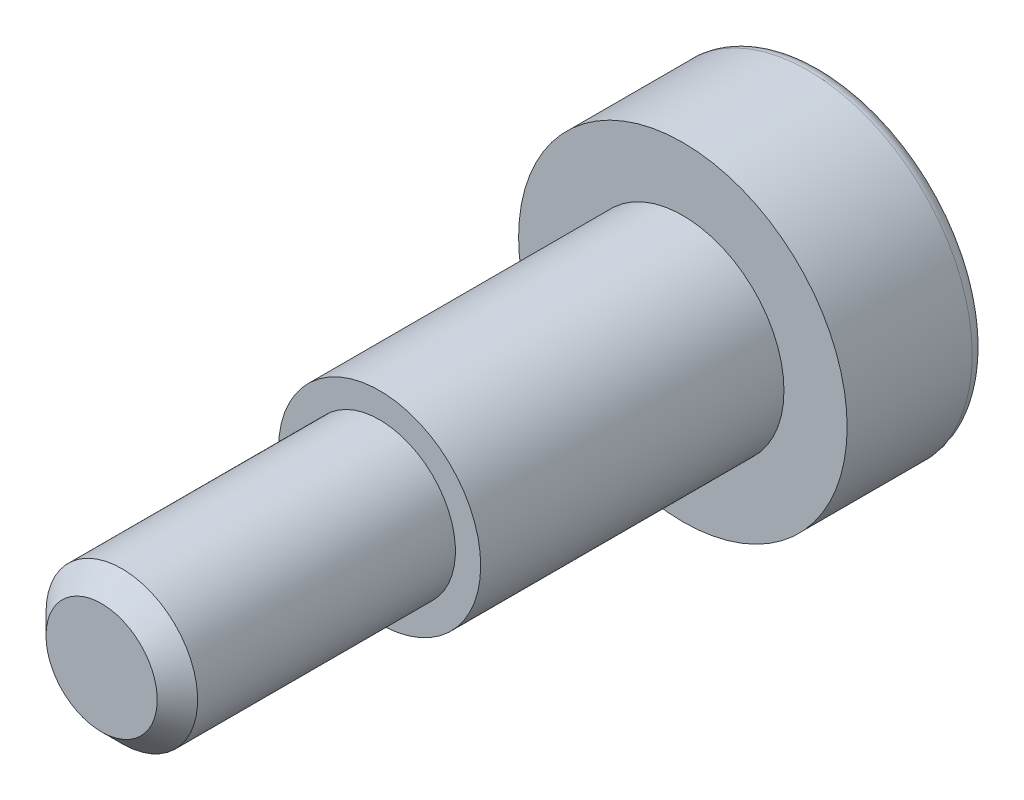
ISO-10303-21;
HEADER;
FILE_DESCRIPTION(('STEP AP214'),'2;1');
FILE_NAME('part.step','',(''),(''),'','','');
FILE_SCHEMA(('AUTOMOTIVE_DESIGN { 1 0 10303 214 1 1 1 1 }'));
ENDSEC;
DATA;
#1=APPLICATION_CONTEXT('core data for automotive mechanical design processes');
#2=APPLICATION_PROTOCOL_DEFINITION('international standard','automotive_design',2000,#1);
#3=PRODUCT_CONTEXT('',#1,'mechanical');
#4=PRODUCT('Part','Part','',(#3));
#5=PRODUCT_RELATED_PRODUCT_CATEGORY('part','',(#4));
#6=PRODUCT_DEFINITION_FORMATION('','',#4);
#7=PRODUCT_DEFINITION_CONTEXT('part definition',#1,'design');
#8=PRODUCT_DEFINITION('design','',#6,#7);
#9=PRODUCT_DEFINITION_SHAPE('','',#8);
#10=(LENGTH_UNIT() NAMED_UNIT(*) SI_UNIT(.MILLI.,.METRE.));
#11=(NAMED_UNIT(*) PLANE_ANGLE_UNIT() SI_UNIT($,.RADIAN.));
#12=(NAMED_UNIT(*) SI_UNIT($,.STERADIAN.) SOLID_ANGLE_UNIT());
#13=UNCERTAINTY_MEASURE_WITH_UNIT(LENGTH_MEASURE(1.E-05),#10,'distance_accuracy_value','');
#14=(GEOMETRIC_REPRESENTATION_CONTEXT(3) GLOBAL_UNCERTAINTY_ASSIGNED_CONTEXT((#13)) GLOBAL_UNIT_ASSIGNED_CONTEXT((#10,
#11,#12)) REPRESENTATION_CONTEXT('',''));
#15=CARTESIAN_POINT('',(0.,0.,0.));
#16=DIRECTION('',(0.,0.,1.));
#17=DIRECTION('',(1.,0.,0.));
#18=AXIS2_PLACEMENT_3D('',#15,#16,#17);
#19=CARTESIAN_POINT('',(0.,1.38777878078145E-13,12.));
#20=DIRECTION('',(0.,0.,0.999999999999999));
#21=DIRECTION('',(0.999999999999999,0.,0.));
#22=AXIS2_PLACEMENT_3D('',#19,#20,#21);
#23=PLANE('',#22);
#24=CARTESIAN_POINT('',(0.,1.38777878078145E-13,12.));
#25=DIRECTION('',(0.,0.,0.999999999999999));
#26=DIRECTION('',(0.999999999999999,0.,0.));
#27=AXIS2_PLACEMENT_3D('',#24,#25,#26);
#28=CIRCLE('',#27,4.);
#29=CARTESIAN_POINT('',(4.00000000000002,1.38666855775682E-13,12.));
#30=VERTEX_POINT('',#29);
#31=EDGE_CURVE('E107',#30,#30,#28,.T.);
#32=ORIENTED_EDGE('',*,*,#31,.T.);
#33=EDGE_LOOP('',(#32));
#34=FACE_BOUND('',#33,.T.);
#35=CARTESIAN_POINT('',(0.,1.38777878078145E-13,12.));
#36=DIRECTION('',(0.,0.,0.999999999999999));
#37=DIRECTION('',(0.999999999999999,0.,0.));
#38=AXIS2_PLACEMENT_3D('',#35,#36,#37);
#39=CIRCLE('',#38,3.);
#40=CARTESIAN_POINT('',(-2.99999999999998,1.38861144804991E-13,12.));
#41=VERTEX_POINT('',#40);
#42=EDGE_CURVE('E312',#41,#41,#39,.T.);
#43=ORIENTED_EDGE('',*,*,#42,.F.);
#44=EDGE_LOOP('',(#43));
#45=FACE_BOUND('',#44,.T.);
#46=ADVANCED_FACE('F32',(#34,#45),#23,.T.);
#47=CARTESIAN_POINT('',(0.,1.38777878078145E-13,-5.50000000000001));
#48=DIRECTION('',(0.,0.,0.999999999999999));
#49=DIRECTION('',(0.999999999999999,0.,0.));
#50=AXIS2_PLACEMENT_3D('',#47,#48,#49);
#51=PLANE('',#50);
#52=CARTESIAN_POINT('',(0.,1.38777878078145E-13,-5.50000000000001));
#53=DIRECTION('',(0.,0.,-0.999999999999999));
#54=DIRECTION('',(-0.999999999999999,0.,0.));
#55=AXIS2_PLACEMENT_3D('',#52,#53,#54);
#56=CIRCLE('',#55,5.95);
#57=CARTESIAN_POINT('',(-5.94999999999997,1.38943023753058E-13,-5.50000000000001));
#58=VERTEX_POINT('',#57);
#59=EDGE_CURVE('E145',#58,#58,#56,.T.);
#60=ORIENTED_EDGE('',*,*,#59,.T.);
#61=EDGE_LOOP('',(#60));
#62=FACE_BOUND('',#61,.T.);
#63=DIRECTION('',(-0.866025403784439,0.499999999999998,0.));
#64=VECTOR('',#63,1.);
#65=CARTESIAN_POINT('',(0.,3.46410161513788,-5.50000000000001));
#66=LINE('',#65,#64);
#67=CARTESIAN_POINT('',(3.00000000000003,1.73205080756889,-5.50000000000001));
#68=VERTEX_POINT('',#67);
#69=CARTESIAN_POINT('',(0.,3.46410161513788,-5.50000000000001));
#70=VERTEX_POINT('',#69);
#71=EDGE_CURVE('E47',#68,#70,#66,.T.);
#72=ORIENTED_EDGE('',*,*,#71,.T.);
#73=DIRECTION('',(-0.866025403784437,-0.500000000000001,0.));
#74=VECTOR('',#73,1.);
#75=CARTESIAN_POINT('',(0.,3.46410161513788,-5.50000000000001));
#76=LINE('',#75,#74);
#77=CARTESIAN_POINT('',(-2.99999999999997,1.73205080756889,-5.50000000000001));
#78=VERTEX_POINT('',#77);
#79=EDGE_CURVE('E87',#70,#78,#76,.T.);
#80=ORIENTED_EDGE('',*,*,#79,.T.);
#81=DIRECTION('',(0.,-0.999999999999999,0.));
#82=VECTOR('',#81,1.);
#83=CARTESIAN_POINT('',(-2.99999999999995,-1.73205080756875,-5.50000000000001));
#84=LINE('',#83,#82);
#85=CARTESIAN_POINT('',(-2.99999999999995,-1.73205080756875,-5.50000000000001));
#86=VERTEX_POINT('',#85);
#87=EDGE_CURVE('E95',#78,#86,#84,.T.);
#88=ORIENTED_EDGE('',*,*,#87,.T.);
#89=DIRECTION('',(0.866025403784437,-0.500000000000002,0.));
#90=VECTOR('',#89,1.);
#91=CARTESIAN_POINT('',(0.,-3.46410161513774,-5.50000000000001));
#92=LINE('',#91,#90);
#93=CARTESIAN_POINT('',(0.,-3.46410161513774,-5.50000000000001));
#94=VERTEX_POINT('',#93);
#95=EDGE_CURVE('E115',#86,#94,#92,.T.);
#96=ORIENTED_EDGE('',*,*,#95,.T.);
#97=DIRECTION('',(0.866025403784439,0.499999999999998,0.));
#98=VECTOR('',#97,1.);
#99=CARTESIAN_POINT('',(0.,-3.46410161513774,-5.50000000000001));
#100=LINE('',#99,#98);
#101=CARTESIAN_POINT('',(3.00000000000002,-1.73205080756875,-5.50000000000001));
#102=VERTEX_POINT('',#101);
#103=EDGE_CURVE('E118',#94,#102,#100,.T.);
#104=ORIENTED_EDGE('',*,*,#103,.T.);
#105=DIRECTION('',(0.,1.,0.));
#106=VECTOR('',#105,1.);
#107=CARTESIAN_POINT('',(3.00000000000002,-1.73205080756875,-5.50000000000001));
#108=LINE('',#107,#106);
#109=EDGE_CURVE('E106',#102,#68,#108,.T.);
#110=ORIENTED_EDGE('',*,*,#109,.T.);
#111=EDGE_LOOP('',(#72,#80,#88,#96,#104,#110));
#112=FACE_BOUND('',#111,.T.);
#113=ADVANCED_FACE('F34',(#62,#112),#51,.F.);
#114=CARTESIAN_POINT('',(0.,1.38777878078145E-13,-4.95));
#115=DIRECTION('',(0.,0.,-0.999999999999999));
#116=DIRECTION('',(-0.999999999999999,0.,0.));
#117=AXIS2_PLACEMENT_3D('',#114,#115,#116);
#118=TOROIDAL_SURFACE('',#117,5.95,0.550000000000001);
#119=ORIENTED_EDGE('',*,*,#59,.F.);
#120=EDGE_LOOP('',(#119));
#121=FACE_BOUND('',#120,.T.);
#122=CARTESIAN_POINT('',(0.,1.38777878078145E-13,-4.95));
#123=DIRECTION('',(0.,0.,-0.999999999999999));
#124=DIRECTION('',(-0.999999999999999,0.,0.));
#125=AXIS2_PLACEMENT_3D('',#122,#123,#124);
#126=CIRCLE('',#125,6.5);
#127=CARTESIAN_POINT('',(-6.49999999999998,1.38958289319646E-13,-4.95));
#128=VERTEX_POINT('',#127);
#129=EDGE_CURVE('E142',#128,#128,#126,.T.);
#130=ORIENTED_EDGE('',*,*,#129,.T.);
#131=EDGE_LOOP('',(#130));
#132=FACE_BOUND('',#131,.T.);
#133=ADVANCED_FACE('F168',(#121,#132),#118,.T.);
#134=CARTESIAN_POINT('',(0.,1.38777878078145E-13,0.));
#135=DIRECTION('',(0.,0.,-0.999999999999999));
#136=DIRECTION('',(-0.999999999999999,0.,0.));
#137=AXIS2_PLACEMENT_3D('',#134,#135,#136);
#138=CYLINDRICAL_SURFACE('',#137,6.5);
#139=CARTESIAN_POINT('',(0.,1.38777878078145E-13,0.));
#140=DIRECTION('',(0.,0.,-0.999999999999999));
#141=DIRECTION('',(-0.999999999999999,0.,0.));
#142=AXIS2_PLACEMENT_3D('',#139,#140,#141);
#143=CIRCLE('',#142,6.5);
#144=CARTESIAN_POINT('',(-6.49999999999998,1.38958289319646E-13,0.));
#145=VERTEX_POINT('',#144);
#146=EDGE_CURVE('E101',#145,#145,#143,.T.);
#147=CARTESIAN_POINT('',(-6.49999999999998,1.38958289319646E-13,-4.95));
#148=CARTESIAN_POINT('',(-6.49999999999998,1.38958289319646E-13,-4.8984375));
#149=CARTESIAN_POINT('',(-6.49999999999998,1.38958289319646E-13,-4.846875));
#150=CARTESIAN_POINT('',(-6.49999999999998,1.38958289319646E-13,-4.74375));
#151=CARTESIAN_POINT('',(-6.49999999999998,1.38958289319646E-13,-4.6921875));
#152=CARTESIAN_POINT('',(-6.49999999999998,1.38958289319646E-13,-4.5890625));
#153=CARTESIAN_POINT('',(-6.49999999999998,1.38958289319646E-13,-4.5375));
#154=CARTESIAN_POINT('',(-6.49999999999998,1.38958289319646E-13,-4.434375));
#155=CARTESIAN_POINT('',(-6.49999999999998,1.38958289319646E-13,-4.3828125));
#156=CARTESIAN_POINT('',(-6.49999999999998,1.38958289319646E-13,-4.2796875));
#157=CARTESIAN_POINT('',(-6.49999999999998,1.38958289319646E-13,-4.228125));
#158=CARTESIAN_POINT('',(-6.49999999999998,1.38958289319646E-13,-4.125));
#159=CARTESIAN_POINT('',(-6.49999999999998,1.38958289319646E-13,-4.0734375));
#160=CARTESIAN_POINT('',(-6.49999999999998,1.38958289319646E-13,-3.9703125));
#161=CARTESIAN_POINT('',(-6.49999999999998,1.38958289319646E-13,-3.91875));
#162=CARTESIAN_POINT('',(-6.49999999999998,1.38958289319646E-13,-3.815625));
#163=CARTESIAN_POINT('',(-6.49999999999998,1.38958289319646E-13,-3.7640625));
#164=CARTESIAN_POINT('',(-6.49999999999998,1.38958289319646E-13,-3.6609375));
#165=CARTESIAN_POINT('',(-6.49999999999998,1.38958289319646E-13,-3.609375));
#166=CARTESIAN_POINT('',(-6.49999999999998,1.38958289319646E-13,-3.50625));
#167=CARTESIAN_POINT('',(-6.49999999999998,1.38958289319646E-13,-3.4546875));
#168=CARTESIAN_POINT('',(-6.49999999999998,1.38958289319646E-13,-3.3515625));
#169=CARTESIAN_POINT('',(-6.49999999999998,1.38958289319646E-13,-3.3));
#170=CARTESIAN_POINT('',(-6.49999999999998,1.38958289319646E-13,-3.196875));
#171=CARTESIAN_POINT('',(-6.49999999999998,1.38958289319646E-13,-3.1453125));
#172=CARTESIAN_POINT('',(-6.49999999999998,1.38958289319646E-13,-3.0421875));
#173=CARTESIAN_POINT('',(-6.49999999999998,1.38958289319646E-13,-2.990625));
#174=CARTESIAN_POINT('',(-6.49999999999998,1.38958289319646E-13,-2.8875));
#175=CARTESIAN_POINT('',(-6.49999999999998,1.38958289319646E-13,-2.8359375));
#176=CARTESIAN_POINT('',(-6.49999999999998,1.38958289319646E-13,-2.7328125));
#177=CARTESIAN_POINT('',(-6.49999999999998,1.38958289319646E-13,-2.68125));
#178=CARTESIAN_POINT('',(-6.49999999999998,1.38958289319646E-13,-2.578125));
#179=CARTESIAN_POINT('',(-6.49999999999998,1.38958289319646E-13,-2.5265625));
#180=CARTESIAN_POINT('',(-6.49999999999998,1.38958289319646E-13,-2.4234375));
#181=CARTESIAN_POINT('',(-6.49999999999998,1.38958289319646E-13,-2.371875));
#182=CARTESIAN_POINT('',(-6.49999999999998,1.38958289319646E-13,-2.26875));
#183=CARTESIAN_POINT('',(-6.49999999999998,1.38958289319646E-13,-2.2171875));
#184=CARTESIAN_POINT('',(-6.49999999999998,1.38958289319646E-13,-2.1140625));
#185=CARTESIAN_POINT('',(-6.49999999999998,1.38958289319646E-13,-2.0625));
#186=CARTESIAN_POINT('',(-6.49999999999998,1.38958289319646E-13,-1.959375));
#187=CARTESIAN_POINT('',(-6.49999999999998,1.38958289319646E-13,-1.9078125));
#188=CARTESIAN_POINT('',(-6.49999999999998,1.38958289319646E-13,-1.8046875));
#189=CARTESIAN_POINT('',(-6.49999999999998,1.38958289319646E-13,-1.753125));
#190=CARTESIAN_POINT('',(-6.49999999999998,1.38958289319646E-13,-1.65));
#191=CARTESIAN_POINT('',(-6.49999999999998,1.38958289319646E-13,-1.5984375));
#192=CARTESIAN_POINT('',(-6.49999999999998,1.38958289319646E-13,-1.4953125));
#193=CARTESIAN_POINT('',(-6.49999999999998,1.38958289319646E-13,-1.44375));
#194=CARTESIAN_POINT('',(-6.49999999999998,1.38958289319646E-13,-1.340625));
#195=CARTESIAN_POINT('',(-6.49999999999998,1.38958289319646E-13,-1.2890625));
#196=CARTESIAN_POINT('',(-6.49999999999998,1.38958289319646E-13,-1.1859375));
#197=CARTESIAN_POINT('',(-6.49999999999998,1.38958289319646E-13,-1.134375));
#198=CARTESIAN_POINT('',(-6.49999999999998,1.38958289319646E-13,-1.03125));
#199=CARTESIAN_POINT('',(-6.49999999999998,1.38958289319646E-13,-0.979687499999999));
#200=CARTESIAN_POINT('',(-6.49999999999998,1.38958289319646E-13,-0.876562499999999));
#201=CARTESIAN_POINT('',(-6.49999999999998,1.38958289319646E-13,-0.824999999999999));
#202=CARTESIAN_POINT('',(-6.49999999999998,1.38958289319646E-13,-0.721874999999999));
#203=CARTESIAN_POINT('',(-6.49999999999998,1.38958289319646E-13,-0.670312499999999));
#204=CARTESIAN_POINT('',(-6.49999999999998,1.38958289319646E-13,-0.5671875));
#205=CARTESIAN_POINT('',(-6.49999999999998,1.38958289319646E-13,-0.515625));
#206=CARTESIAN_POINT('',(-6.49999999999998,1.38958289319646E-13,-0.4125));
#207=CARTESIAN_POINT('',(-6.49999999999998,1.38958289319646E-13,-0.360937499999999));
#208=CARTESIAN_POINT('',(-6.49999999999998,1.38958289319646E-13,-0.2578125));
#209=CARTESIAN_POINT('',(-6.49999999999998,1.38958289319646E-13,-0.20625));
#210=CARTESIAN_POINT('',(-6.49999999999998,1.38958289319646E-13,-0.103125));
#211=CARTESIAN_POINT('',(-6.49999999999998,1.38958289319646E-13,-0.0515625));
#212=CARTESIAN_POINT('',(-6.49999999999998,1.38958289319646E-13,0.));
#213=B_SPLINE_CURVE_WITH_KNOTS('',3,(#147,#148,#149,#150,#151,#152,#153,#154,#155,#156,#157,
#158,#159,#160,#161,#162,#163,#164,#165,#166,#167,#168,#169,#170,#171,#172,#173,#174,#175,#176,
#177,#178,#179,#180,#181,#182,#183,#184,#185,#186,#187,#188,#189,#190,#191,#192,#193,#194,#195,
#196,#197,#198,#199,#200,#201,#202,#203,#204,#205,#206,#207,#208,#209,#210,#211,#212),
.UNSPECIFIED.,.F.,.F.,(4,2,2,2,2,2,2,2,2,2,2,2,2,2,2,2,2,2,2,2,2,2,2,2,2,2,2,2,2,2,2,2,4),(0.,
0.1546875,0.309375,0.4640625,0.61875,0.773437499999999,0.928124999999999,1.0828125,1.2375,
1.3921875,1.546875,1.7015625,1.85625,2.0109375,2.165625,2.3203125,2.475,2.6296875,2.784375,
2.9390625,3.09375,3.2484375,3.403125,3.5578125,3.7125,3.8671875,4.021875,4.1765625,4.33125,
4.4859375,4.640625,4.7953125,4.95),.UNSPECIFIED.);
#214=EDGE_CURVE('BSEAM201',#128,#145,#213,.T.);
#215=ORIENTED_EDGE('',*,*,#129,.F.);
#216=ORIENTED_EDGE('',*,*,#146,.T.);
#217=ORIENTED_EDGE('',*,*,#214,.T.);
#218=ORIENTED_EDGE('',*,*,#214,.F.);
#219=EDGE_LOOP('',(#215,#217,#216,#218));
#220=FACE_BOUND('',#219,.T.);
#221=ADVANCED_FACE('F201',(#220),#138,.T.);
#222=CARTESIAN_POINT('',(0.,1.38777878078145E-13,0.));
#223=DIRECTION('',(0.,0.,-0.999999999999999));
#224=DIRECTION('',(-0.999999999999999,0.,0.));
#225=AXIS2_PLACEMENT_3D('',#222,#223,#224);
#226=PLANE('',#225);
#227=CARTESIAN_POINT('',(0.,1.38777878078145E-13,0.));
#228=DIRECTION('',(0.,0.,0.999999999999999));
#229=DIRECTION('',(0.999999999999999,0.,0.));
#230=AXIS2_PLACEMENT_3D('',#227,#228,#229);
#231=CIRCLE('',#230,4.);
#232=CARTESIAN_POINT('',(4.00000000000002,1.38666855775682E-13,0.));
#233=VERTEX_POINT('',#232);
#234=EDGE_CURVE('E110',#233,#233,#231,.T.);
#235=ORIENTED_EDGE('',*,*,#234,.F.);
#236=EDGE_LOOP('',(#235));
#237=FACE_BOUND('',#236,.T.);
#238=ORIENTED_EDGE('',*,*,#146,.F.);
#239=EDGE_LOOP('',(#238));
#240=FACE_BOUND('',#239,.T.);
#241=ADVANCED_FACE('F198',(#237,#240),#226,.F.);
#242=CARTESIAN_POINT('',(0.,3.46410161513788,-1.5));
#243=DIRECTION('',(-0.499999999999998,-0.866025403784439,0.));
#244=DIRECTION('',(0.866025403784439,-0.499999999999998,0.));
#245=AXIS2_PLACEMENT_3D('',#242,#243,#244);
#246=PLANE('',#245);
#247=ORIENTED_EDGE('',*,*,#71,.F.);
#248=DIRECTION('',(0.,0.,-0.999999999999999));
#249=VECTOR('',#248,1.);
#250=CARTESIAN_POINT('',(3.00000000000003,1.73205080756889,-1.5));
#251=LINE('',#250,#249);
#252=CARTESIAN_POINT('',(3.00000000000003,1.73205080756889,-1.5));
#253=VERTEX_POINT('',#252);
#254=EDGE_CURVE('E131',#253,#68,#251,.T.);
#255=ORIENTED_EDGE('',*,*,#254,.F.);
#256=DIRECTION('',(-0.866025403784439,0.499999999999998,0.));
#257=VECTOR('',#256,1.);
#258=CARTESIAN_POINT('',(0.,3.46410161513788,-1.5));
#259=LINE('',#258,#257);
#260=CARTESIAN_POINT('',(0.,3.46410161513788,-1.5));
#261=VERTEX_POINT('',#260);
#262=EDGE_CURVE('E100',#253,#261,#259,.T.);
#263=ORIENTED_EDGE('',*,*,#262,.T.);
#264=DIRECTION('',(0.,0.,-0.999999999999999));
#265=VECTOR('',#264,1.);
#266=CARTESIAN_POINT('',(0.,3.46410161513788,-1.5));
#267=LINE('',#266,#265);
#268=EDGE_CURVE('E89',#261,#70,#267,.T.);
#269=ORIENTED_EDGE('',*,*,#268,.T.);
#270=EDGE_LOOP('',(#247,#255,#263,#269));
#271=FACE_BOUND('',#270,.T.);
#272=ADVANCED_FACE('F98',(#271),#246,.T.);
#273=CARTESIAN_POINT('',(0.,3.46410161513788,-1.5));
#274=DIRECTION('',(0.500000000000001,-0.866025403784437,0.));
#275=DIRECTION('',(0.866025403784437,0.500000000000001,0.));
#276=AXIS2_PLACEMENT_3D('',#273,#274,#275);
#277=PLANE('',#276);
#278=ORIENTED_EDGE('',*,*,#79,.F.);
#279=ORIENTED_EDGE('',*,*,#268,.F.);
#280=DIRECTION('',(-0.866025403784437,-0.500000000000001,0.));
#281=VECTOR('',#280,1.);
#282=CARTESIAN_POINT('',(0.,3.46410161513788,-1.5));
#283=LINE('',#282,#281);
#284=CARTESIAN_POINT('',(-2.99999999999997,1.73205080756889,-1.5));
#285=VERTEX_POINT('',#284);
#286=EDGE_CURVE('E122',#261,#285,#283,.T.);
#287=ORIENTED_EDGE('',*,*,#286,.T.);
#288=DIRECTION('',(0.,0.,-0.999999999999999));
#289=VECTOR('',#288,1.);
#290=CARTESIAN_POINT('',(-2.99999999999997,1.73205080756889,-1.5));
#291=LINE('',#290,#289);
#292=EDGE_CURVE('E91',#285,#78,#291,.T.);
#293=ORIENTED_EDGE('',*,*,#292,.T.);
#294=EDGE_LOOP('',(#278,#279,#287,#293));
#295=FACE_BOUND('',#294,.T.);
#296=ADVANCED_FACE('F88',(#295),#277,.T.);
#297=CARTESIAN_POINT('',(-2.99999999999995,-1.73205080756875,-1.5));
#298=DIRECTION('',(0.999999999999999,0.,0.));
#299=DIRECTION('',(0.,0.,-0.999999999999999));
#300=AXIS2_PLACEMENT_3D('',#297,#298,#299);
#301=PLANE('',#300);
#302=ORIENTED_EDGE('',*,*,#87,.F.);
#303=ORIENTED_EDGE('',*,*,#292,.F.);
#304=DIRECTION('',(0.,-0.999999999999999,0.));
#305=VECTOR('',#304,1.);
#306=CARTESIAN_POINT('',(-2.99999999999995,-1.73205080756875,-1.5));
#307=LINE('',#306,#305);
#308=CARTESIAN_POINT('',(-2.99999999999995,-1.73205080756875,-1.5));
#309=VERTEX_POINT('',#308);
#310=EDGE_CURVE('E124',#285,#309,#307,.T.);
#311=ORIENTED_EDGE('',*,*,#310,.T.);
#312=DIRECTION('',(0.,0.,-0.999999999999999));
#313=VECTOR('',#312,1.);
#314=CARTESIAN_POINT('',(-2.99999999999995,-1.73205080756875,-1.5));
#315=LINE('',#314,#313);
#316=EDGE_CURVE('E137',#309,#86,#315,.T.);
#317=ORIENTED_EDGE('',*,*,#316,.T.);
#318=EDGE_LOOP('',(#302,#303,#311,#317));
#319=FACE_BOUND('',#318,.T.);
#320=ADVANCED_FACE('F189',(#319),#301,.T.);
#321=CARTESIAN_POINT('',(0.,-3.46410161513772,-1.5));
#322=DIRECTION('',(0.500000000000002,0.866025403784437,0.));
#323=DIRECTION('',(-0.866025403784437,0.500000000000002,0.));
#324=AXIS2_PLACEMENT_3D('',#321,#322,#323);
#325=PLANE('',#324);
#326=ORIENTED_EDGE('',*,*,#95,.F.);
#327=ORIENTED_EDGE('',*,*,#316,.F.);
#328=DIRECTION('',(0.866025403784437,-0.500000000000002,0.));
#329=VECTOR('',#328,1.);
#330=CARTESIAN_POINT('',(0.,-3.46410161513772,-1.5));
#331=LINE('',#330,#329);
#332=CARTESIAN_POINT('',(0.,-3.46410161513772,-1.5));
#333=VERTEX_POINT('',#332);
#334=EDGE_CURVE('E126',#309,#333,#331,.T.);
#335=ORIENTED_EDGE('',*,*,#334,.T.);
#336=DIRECTION('',(0.,0.,-0.999999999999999));
#337=VECTOR('',#336,1.);
#338=CARTESIAN_POINT('',(0.,-3.46410161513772,-1.5));
#339=LINE('',#338,#337);
#340=EDGE_CURVE('E135',#333,#94,#339,.T.);
#341=ORIENTED_EDGE('',*,*,#340,.T.);
#342=EDGE_LOOP('',(#326,#327,#335,#341));
#343=FACE_BOUND('',#342,.T.);
#344=ADVANCED_FACE('F185',(#343),#325,.T.);
#345=CARTESIAN_POINT('',(0.,-3.46410161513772,-1.5));
#346=DIRECTION('',(-0.499999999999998,0.866025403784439,0.));
#347=DIRECTION('',(-0.866025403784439,-0.499999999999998,0.));
#348=AXIS2_PLACEMENT_3D('',#345,#346,#347);
#349=PLANE('',#348);
#350=ORIENTED_EDGE('',*,*,#103,.F.);
#351=ORIENTED_EDGE('',*,*,#340,.F.);
#352=DIRECTION('',(0.866025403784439,0.499999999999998,0.));
#353=VECTOR('',#352,1.);
#354=CARTESIAN_POINT('',(0.,-3.46410161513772,-1.5));
#355=LINE('',#354,#353);
#356=CARTESIAN_POINT('',(3.00000000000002,-1.73205080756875,-1.5));
#357=VERTEX_POINT('',#356);
#358=EDGE_CURVE('E128',#333,#357,#355,.T.);
#359=ORIENTED_EDGE('',*,*,#358,.T.);
#360=DIRECTION('',(0.,0.,-0.999999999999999));
#361=VECTOR('',#360,1.);
#362=CARTESIAN_POINT('',(3.00000000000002,-1.73205080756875,-1.5));
#363=LINE('',#362,#361);
#364=EDGE_CURVE('E133',#357,#102,#363,.T.);
#365=ORIENTED_EDGE('',*,*,#364,.T.);
#366=EDGE_LOOP('',(#350,#351,#359,#365));
#367=FACE_BOUND('',#366,.T.);
#368=ADVANCED_FACE('F182',(#367),#349,.T.);
#369=CARTESIAN_POINT('',(3.00000000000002,-1.73205080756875,-1.5));
#370=DIRECTION('',(-1.,0.,0.));
#371=DIRECTION('',(0.,-1.,0.));
#372=AXIS2_PLACEMENT_3D('',#369,#370,#371);
#373=PLANE('',#372);
#374=ORIENTED_EDGE('',*,*,#109,.F.);
#375=ORIENTED_EDGE('',*,*,#364,.F.);
#376=DIRECTION('',(0.,1.,0.));
#377=VECTOR('',#376,1.);
#378=CARTESIAN_POINT('',(3.00000000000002,-1.73205080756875,-1.5));
#379=LINE('',#378,#377);
#380=EDGE_CURVE('E54',#357,#253,#379,.T.);
#381=ORIENTED_EDGE('',*,*,#380,.T.);
#382=ORIENTED_EDGE('',*,*,#254,.T.);
#383=EDGE_LOOP('',(#374,#375,#381,#382));
#384=FACE_BOUND('',#383,.T.);
#385=ADVANCED_FACE('F178',(#384),#373,.T.);
#386=CARTESIAN_POINT('',(-2.99999999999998,5.19615242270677,-1.5));
#387=DIRECTION('',(0.,0.,0.999999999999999));
#388=DIRECTION('',(0.999999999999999,0.,0.));
#389=AXIS2_PLACEMENT_3D('',#386,#387,#388);
#390=PLANE('',#389);
#391=ORIENTED_EDGE('',*,*,#262,.F.);
#392=ORIENTED_EDGE('',*,*,#380,.F.);
#393=ORIENTED_EDGE('',*,*,#358,.F.);
#394=ORIENTED_EDGE('',*,*,#334,.F.);
#395=ORIENTED_EDGE('',*,*,#310,.F.);
#396=ORIENTED_EDGE('',*,*,#286,.F.);
#397=EDGE_LOOP('',(#391,#392,#393,#394,#395,#396));
#398=FACE_BOUND('',#397,.T.);
#399=ADVANCED_FACE('F175',(#398),#390,.F.);
#400=CARTESIAN_POINT('',(0.,1.38777878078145E-13,0.));
#401=DIRECTION('',(0.,0.,0.999999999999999));
#402=DIRECTION('',(0.999999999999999,0.,0.));
#403=AXIS2_PLACEMENT_3D('',#400,#401,#402);
#404=CYLINDRICAL_SURFACE('',#403,4.);
#405=CARTESIAN_POINT('',(4.00000000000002,1.38666855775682E-13,0.));
#406=CARTESIAN_POINT('',(4.00000000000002,1.38666855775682E-13,0.124999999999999));
#407=CARTESIAN_POINT('',(4.00000000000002,1.38666855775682E-13,0.249999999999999));
#408=CARTESIAN_POINT('',(4.00000000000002,1.38666855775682E-13,0.499999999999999));
#409=CARTESIAN_POINT('',(4.00000000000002,1.38666855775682E-13,0.624999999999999));
#410=CARTESIAN_POINT('',(4.00000000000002,1.38666855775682E-13,0.874999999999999));
#411=CARTESIAN_POINT('',(4.00000000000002,1.38666855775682E-13,0.999999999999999));
#412=CARTESIAN_POINT('',(4.00000000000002,1.38666855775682E-13,1.25));
#413=CARTESIAN_POINT('',(4.00000000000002,1.38666855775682E-13,1.375));
#414=CARTESIAN_POINT('',(4.00000000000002,1.38666855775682E-13,1.625));
#415=CARTESIAN_POINT('',(4.00000000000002,1.38666855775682E-13,1.75));
#416=CARTESIAN_POINT('',(4.00000000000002,1.38666855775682E-13,2.));
#417=CARTESIAN_POINT('',(4.00000000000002,1.38666855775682E-13,2.125));
#418=CARTESIAN_POINT('',(4.00000000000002,1.38666855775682E-13,2.375));
#419=CARTESIAN_POINT('',(4.00000000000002,1.38666855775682E-13,2.5));
#420=CARTESIAN_POINT('',(4.00000000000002,1.38666855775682E-13,2.75));
#421=CARTESIAN_POINT('',(4.00000000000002,1.38666855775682E-13,2.875));
#422=CARTESIAN_POINT('',(4.00000000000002,1.38666855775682E-13,3.125));
#423=CARTESIAN_POINT('',(4.00000000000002,1.38666855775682E-13,3.25));
#424=CARTESIAN_POINT('',(4.00000000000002,1.38666855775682E-13,3.5));
#425=CARTESIAN_POINT('',(4.00000000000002,1.38666855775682E-13,3.625));
#426=CARTESIAN_POINT('',(4.00000000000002,1.38666855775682E-13,3.875));
#427=CARTESIAN_POINT('',(4.00000000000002,1.38666855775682E-13,4.));
#428=CARTESIAN_POINT('',(4.00000000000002,1.38666855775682E-13,4.25));
#429=CARTESIAN_POINT('',(4.00000000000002,1.38666855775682E-13,4.375));
#430=CARTESIAN_POINT('',(4.00000000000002,1.38666855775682E-13,4.625));
#431=CARTESIAN_POINT('',(4.00000000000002,1.38666855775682E-13,4.75));
#432=CARTESIAN_POINT('',(4.00000000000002,1.38666855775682E-13,5.));
#433=CARTESIAN_POINT('',(4.00000000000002,1.38666855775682E-13,5.125));
#434=CARTESIAN_POINT('',(4.00000000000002,1.38666855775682E-13,5.375));
#435=CARTESIAN_POINT('',(4.00000000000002,1.38666855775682E-13,5.5));
#436=CARTESIAN_POINT('',(4.00000000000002,1.38666855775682E-13,5.75));
#437=CARTESIAN_POINT('',(4.00000000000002,1.38666855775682E-13,5.875));
#438=CARTESIAN_POINT('',(4.00000000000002,1.38666855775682E-13,6.125));
#439=CARTESIAN_POINT('',(4.00000000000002,1.38666855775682E-13,6.25));
#440=CARTESIAN_POINT('',(4.00000000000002,1.38666855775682E-13,6.5));
#441=CARTESIAN_POINT('',(4.00000000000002,1.38666855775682E-13,6.625));
#442=CARTESIAN_POINT('',(4.00000000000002,1.38666855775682E-13,6.875));
#443=CARTESIAN_POINT('',(4.00000000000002,1.38666855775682E-13,7.));
#444=CARTESIAN_POINT('',(4.00000000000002,1.38666855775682E-13,7.25));
#445=CARTESIAN_POINT('',(4.00000000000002,1.38666855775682E-13,7.375));
#446=CARTESIAN_POINT('',(4.00000000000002,1.38666855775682E-13,7.625));
#447=CARTESIAN_POINT('',(4.00000000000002,1.38666855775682E-13,7.75));
#448=CARTESIAN_POINT('',(4.00000000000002,1.38666855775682E-13,8.));
#449=CARTESIAN_POINT('',(4.00000000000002,1.38666855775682E-13,8.125));
#450=CARTESIAN_POINT('',(4.00000000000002,1.38666855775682E-13,8.375));
#451=CARTESIAN_POINT('',(4.00000000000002,1.38666855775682E-13,8.5));
#452=CARTESIAN_POINT('',(4.00000000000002,1.38666855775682E-13,8.75));
#453=CARTESIAN_POINT('',(4.00000000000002,1.38666855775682E-13,8.875));
#454=CARTESIAN_POINT('',(4.00000000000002,1.38666855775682E-13,9.125));
#455=CARTESIAN_POINT('',(4.00000000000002,1.38666855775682E-13,9.25));
#456=CARTESIAN_POINT('',(4.00000000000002,1.38666855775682E-13,9.5));
#457=CARTESIAN_POINT('',(4.00000000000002,1.38666855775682E-13,9.625));
#458=CARTESIAN_POINT('',(4.00000000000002,1.38666855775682E-13,9.875));
#459=CARTESIAN_POINT('',(4.00000000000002,1.38666855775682E-13,10.));
#460=CARTESIAN_POINT('',(4.00000000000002,1.38666855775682E-13,10.25));
#461=CARTESIAN_POINT('',(4.00000000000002,1.38666855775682E-13,10.375));
#462=CARTESIAN_POINT('',(4.00000000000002,1.38666855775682E-13,10.625));
#463=CARTESIAN_POINT('',(4.00000000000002,1.38666855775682E-13,10.75));
#464=CARTESIAN_POINT('',(4.00000000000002,1.38666855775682E-13,11.));
#465=CARTESIAN_POINT('',(4.00000000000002,1.38666855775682E-13,11.125));
#466=CARTESIAN_POINT('',(4.00000000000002,1.38666855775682E-13,11.375));
#467=CARTESIAN_POINT('',(4.00000000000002,1.38666855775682E-13,11.5));
#468=CARTESIAN_POINT('',(4.00000000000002,1.38666855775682E-13,11.75));
#469=CARTESIAN_POINT('',(4.00000000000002,1.38666855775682E-13,11.875));
#470=CARTESIAN_POINT('',(4.00000000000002,1.38666855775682E-13,12.));
#471=B_SPLINE_CURVE_WITH_KNOTS('',3,(#405,#406,#407,#408,#409,#410,#411,#412,#413,#414,#415,
#416,#417,#418,#419,#420,#421,#422,#423,#424,#425,#426,#427,#428,#429,#430,#431,#432,#433,#434,
#435,#436,#437,#438,#439,#440,#441,#442,#443,#444,#445,#446,#447,#448,#449,#450,#451,#452,#453,
#454,#455,#456,#457,#458,#459,#460,#461,#462,#463,#464,#465,#466,#467,#468,#469,#470),
.UNSPECIFIED.,.F.,.F.,(4,2,2,2,2,2,2,2,2,2,2,2,2,2,2,2,2,2,2,2,2,2,2,2,2,2,2,2,2,2,2,2,4),(0.,
0.375,0.75,1.125,1.5,1.875,2.25,2.625,3.,3.375,3.75,4.125,4.5,4.875,5.25,5.625,6.,6.375,6.75,
7.125,7.5,7.875,8.25,8.625,9.,9.375,9.75,10.125,10.5,10.875,11.25,11.625,12.),.UNSPECIFIED.);
#472=EDGE_CURVE('BSEAM173',#233,#30,#471,.T.);
#473=ORIENTED_EDGE('',*,*,#234,.T.);
#474=ORIENTED_EDGE('',*,*,#31,.F.);
#475=ORIENTED_EDGE('',*,*,#472,.T.);
#476=ORIENTED_EDGE('',*,*,#472,.F.);
#477=EDGE_LOOP('',(#473,#475,#474,#476));
#478=FACE_BOUND('',#477,.T.);
#479=ADVANCED_FACE('F173',(#478),#404,.T.);
#480=CARTESIAN_POINT('',(0.,1.38777878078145E-13,23.));
#481=DIRECTION('',(0.,0.,-0.999999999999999));
#482=DIRECTION('',(-0.999999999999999,0.,0.));
#483=AXIS2_PLACEMENT_3D('',#480,#481,#482);
#484=CYLINDRICAL_SURFACE('',#483,3.);
#485=CARTESIAN_POINT('',(0.,1.38777878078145E-13,22.2));
#486=DIRECTION('',(0.,0.,0.999999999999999));
#487=DIRECTION('',(0.999999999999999,0.,0.));
#488=AXIS2_PLACEMENT_3D('',#485,#486,#487);
#489=CIRCLE('',#488,3.);
#490=CARTESIAN_POINT('',(-2.99999999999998,1.38861144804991E-13,22.2));
#491=VERTEX_POINT('',#490);
#492=EDGE_CURVE('E11',#491,#491,#489,.F.);
#493=CARTESIAN_POINT('',(-2.99999999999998,1.38861144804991E-13,22.2));
#494=CARTESIAN_POINT('',(-2.99999999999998,1.38861144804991E-13,22.09375));
#495=CARTESIAN_POINT('',(-2.99999999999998,1.38861144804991E-13,21.9875));
#496=CARTESIAN_POINT('',(-2.99999999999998,1.38861144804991E-13,21.775));
#497=CARTESIAN_POINT('',(-2.99999999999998,1.38861144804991E-13,21.66875));
#498=CARTESIAN_POINT('',(-2.99999999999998,1.38861144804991E-13,21.45625));
#499=CARTESIAN_POINT('',(-2.99999999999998,1.38861144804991E-13,21.35));
#500=CARTESIAN_POINT('',(-2.99999999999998,1.38861144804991E-13,21.1375));
#501=CARTESIAN_POINT('',(-2.99999999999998,1.38861144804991E-13,21.03125));
#502=CARTESIAN_POINT('',(-2.99999999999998,1.38861144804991E-13,20.81875));
#503=CARTESIAN_POINT('',(-2.99999999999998,1.38861144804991E-13,20.7125));
#504=CARTESIAN_POINT('',(-2.99999999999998,1.38861144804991E-13,20.5));
#505=CARTESIAN_POINT('',(-2.99999999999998,1.38861144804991E-13,20.39375));
#506=CARTESIAN_POINT('',(-2.99999999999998,1.38861144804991E-13,20.18125));
#507=CARTESIAN_POINT('',(-2.99999999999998,1.38861144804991E-13,20.075));
#508=CARTESIAN_POINT('',(-2.99999999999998,1.38861144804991E-13,19.8625));
#509=CARTESIAN_POINT('',(-2.99999999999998,1.38861144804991E-13,19.75625));
#510=CARTESIAN_POINT('',(-2.99999999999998,1.38861144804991E-13,19.54375));
#511=CARTESIAN_POINT('',(-2.99999999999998,1.38861144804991E-13,19.4375));
#512=CARTESIAN_POINT('',(-2.99999999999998,1.38861144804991E-13,19.225));
#513=CARTESIAN_POINT('',(-2.99999999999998,1.38861144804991E-13,19.11875));
#514=CARTESIAN_POINT('',(-2.99999999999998,1.38861144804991E-13,18.90625));
#515=CARTESIAN_POINT('',(-2.99999999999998,1.38861144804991E-13,18.8));
#516=CARTESIAN_POINT('',(-2.99999999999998,1.38861144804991E-13,18.5875));
#517=CARTESIAN_POINT('',(-2.99999999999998,1.38861144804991E-13,18.48125));
#518=CARTESIAN_POINT('',(-2.99999999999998,1.38861144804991E-13,18.26875));
#519=CARTESIAN_POINT('',(-2.99999999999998,1.38861144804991E-13,18.1625));
#520=CARTESIAN_POINT('',(-2.99999999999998,1.38861144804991E-13,17.95));
#521=CARTESIAN_POINT('',(-2.99999999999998,1.38861144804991E-13,17.84375));
#522=CARTESIAN_POINT('',(-2.99999999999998,1.38861144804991E-13,17.63125));
#523=CARTESIAN_POINT('',(-2.99999999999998,1.38861144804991E-13,17.525));
#524=CARTESIAN_POINT('',(-2.99999999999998,1.38861144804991E-13,17.3125));
#525=CARTESIAN_POINT('',(-2.99999999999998,1.38861144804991E-13,17.20625));
#526=CARTESIAN_POINT('',(-2.99999999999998,1.38861144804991E-13,16.99375));
#527=CARTESIAN_POINT('',(-2.99999999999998,1.38861144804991E-13,16.8875));
#528=CARTESIAN_POINT('',(-2.99999999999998,1.38861144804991E-13,16.675));
#529=CARTESIAN_POINT('',(-2.99999999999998,1.38861144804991E-13,16.56875));
#530=CARTESIAN_POINT('',(-2.99999999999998,1.38861144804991E-13,16.35625));
#531=CARTESIAN_POINT('',(-2.99999999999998,1.38861144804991E-13,16.25));
#532=CARTESIAN_POINT('',(-2.99999999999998,1.38861144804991E-13,16.0375));
#533=CARTESIAN_POINT('',(-2.99999999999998,1.38861144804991E-13,15.93125));
#534=CARTESIAN_POINT('',(-2.99999999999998,1.38861144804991E-13,15.71875));
#535=CARTESIAN_POINT('',(-2.99999999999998,1.38861144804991E-13,15.6125));
#536=CARTESIAN_POINT('',(-2.99999999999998,1.38861144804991E-13,15.4));
#537=CARTESIAN_POINT('',(-2.99999999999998,1.38861144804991E-13,15.29375));
#538=CARTESIAN_POINT('',(-2.99999999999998,1.38861144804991E-13,15.08125));
#539=CARTESIAN_POINT('',(-2.99999999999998,1.38861144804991E-13,14.975));
#540=CARTESIAN_POINT('',(-2.99999999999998,1.38861144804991E-13,14.7625));
#541=CARTESIAN_POINT('',(-2.99999999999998,1.38861144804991E-13,14.65625));
#542=CARTESIAN_POINT('',(-2.99999999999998,1.38861144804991E-13,14.44375));
#543=CARTESIAN_POINT('',(-2.99999999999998,1.38861144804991E-13,14.3375));
#544=CARTESIAN_POINT('',(-2.99999999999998,1.38861144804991E-13,14.125));
#545=CARTESIAN_POINT('',(-2.99999999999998,1.38861144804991E-13,14.01875));
#546=CARTESIAN_POINT('',(-2.99999999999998,1.38861144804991E-13,13.80625));
#547=CARTESIAN_POINT('',(-2.99999999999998,1.38861144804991E-13,13.7));
#548=CARTESIAN_POINT('',(-2.99999999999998,1.38861144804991E-13,13.4875));
#549=CARTESIAN_POINT('',(-2.99999999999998,1.38861144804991E-13,13.38125));
#550=CARTESIAN_POINT('',(-2.99999999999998,1.38861144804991E-13,13.16875));
#551=CARTESIAN_POINT('',(-2.99999999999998,1.38861144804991E-13,13.0625));
#552=CARTESIAN_POINT('',(-2.99999999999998,1.38861144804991E-13,12.85));
#553=CARTESIAN_POINT('',(-2.99999999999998,1.38861144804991E-13,12.74375));
#554=CARTESIAN_POINT('',(-2.99999999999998,1.38861144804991E-13,12.53125));
#555=CARTESIAN_POINT('',(-2.99999999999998,1.38861144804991E-13,12.425));
#556=CARTESIAN_POINT('',(-2.99999999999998,1.38861144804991E-13,12.2125));
#557=CARTESIAN_POINT('',(-2.99999999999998,1.38861144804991E-13,12.10625));
#558=CARTESIAN_POINT('',(-2.99999999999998,1.38861144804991E-13,12.));
#559=B_SPLINE_CURVE_WITH_KNOTS('',3,(#493,#494,#495,#496,#497,#498,#499,#500,#501,#502,#503,
#504,#505,#506,#507,#508,#509,#510,#511,#512,#513,#514,#515,#516,#517,#518,#519,#520,#521,#522,
#523,#524,#525,#526,#527,#528,#529,#530,#531,#532,#533,#534,#535,#536,#537,#538,#539,#540,#541,
#542,#543,#544,#545,#546,#547,#548,#549,#550,#551,#552,#553,#554,#555,#556,#557,#558),
.UNSPECIFIED.,.F.,.F.,(4,2,2,2,2,2,2,2,2,2,2,2,2,2,2,2,2,2,2,2,2,2,2,2,2,2,2,2,2,2,2,2,4),(0.,
0.318750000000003,0.637500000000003,0.956250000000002,1.275,1.59375,1.9125,2.23125,2.55,2.86875,
3.1875,3.50625,3.825,4.14375,4.4625,4.78125,5.1,5.41875,5.7375,6.05625,6.375,6.69375,7.0125,
7.33125,7.65,7.96875,8.2875,8.60625,8.925,9.24375,9.5625,9.88125,10.2),.UNSPECIFIED.);
#560=EDGE_CURVE('BSEAM159',#491,#41,#559,.T.);
#561=ORIENTED_EDGE('',*,*,#492,.T.);
#562=ORIENTED_EDGE('',*,*,#42,.T.);
#563=ORIENTED_EDGE('',*,*,#560,.T.);
#564=ORIENTED_EDGE('',*,*,#560,.F.);
#565=EDGE_LOOP('',(#561,#563,#562,#564));
#566=FACE_BOUND('',#565,.T.);
#567=ADVANCED_FACE('F159',(#566),#484,.T.);
#568=CARTESIAN_POINT('',(0.,1.38777878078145E-13,23.));
#569=DIRECTION('',(0.,0.,0.999999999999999));
#570=DIRECTION('',(0.999999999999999,0.,0.));
#571=AXIS2_PLACEMENT_3D('',#568,#569,#570);
#572=PLANE('',#571);
#573=CARTESIAN_POINT('',(0.,1.38777878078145E-13,23.));
#574=DIRECTION('',(0.,0.,0.999999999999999));
#575=DIRECTION('',(0.999999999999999,0.,0.));
#576=AXIS2_PLACEMENT_3D('',#573,#574,#575);
#577=CIRCLE('',#576,2.2);
#578=CARTESIAN_POINT('',(-2.19999999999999,1.38838940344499E-13,23.));
#579=VERTEX_POINT('',#578);
#580=EDGE_CURVE('E40',#579,#579,#577,.T.);
#581=ORIENTED_EDGE('',*,*,#580,.T.);
#582=EDGE_LOOP('',(#581));
#583=FACE_BOUND('',#582,.T.);
#584=ADVANCED_FACE('F150',(#583),#572,.T.);
#585=CARTESIAN_POINT('',(0.,1.38777878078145E-13,23.));
#586=DIRECTION('',(0.,0.,-0.999999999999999));
#587=DIRECTION('',(-0.999999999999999,0.,0.));
#588=AXIS2_PLACEMENT_3D('',#585,#586,#587);
#589=CONICAL_SURFACE('',#588,2.2,0.785398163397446);
#590=CARTESIAN_POINT('',(-2.99999999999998,1.38861144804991E-13,22.2));
#591=CARTESIAN_POINT('',(-2.99166666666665,1.38860913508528E-13,22.2083333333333));
#592=CARTESIAN_POINT('',(-2.98333333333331,1.38860682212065E-13,22.2166666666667));
#593=CARTESIAN_POINT('',(-2.96666666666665,1.38860219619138E-13,22.2333333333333));
#594=CARTESIAN_POINT('',(-2.95833333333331,1.38859988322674E-13,22.2416666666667));
#595=CARTESIAN_POINT('',(-2.94166666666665,1.38859525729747E-13,22.2583333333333));
#596=CARTESIAN_POINT('',(-2.93333333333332,1.38859294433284E-13,22.2666666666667));
#597=CARTESIAN_POINT('',(-2.91666666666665,1.38858831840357E-13,22.2833333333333));
#598=CARTESIAN_POINT('',(-2.90833333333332,1.38858600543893E-13,22.2916666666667));
#599=CARTESIAN_POINT('',(-2.89166666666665,1.38858137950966E-13,22.3083333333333));
#600=CARTESIAN_POINT('',(-2.88333333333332,1.38857906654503E-13,22.3166666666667));
#601=CARTESIAN_POINT('',(-2.86666666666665,1.38857444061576E-13,22.3333333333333));
#602=CARTESIAN_POINT('',(-2.85833333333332,1.38857212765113E-13,22.3416666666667));
#603=CARTESIAN_POINT('',(-2.84166666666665,1.38856750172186E-13,22.3583333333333));
#604=CARTESIAN_POINT('',(-2.83333333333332,1.38856518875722E-13,22.3666666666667));
#605=CARTESIAN_POINT('',(-2.81666666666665,1.38856056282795E-13,22.3833333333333));
#606=CARTESIAN_POINT('',(-2.80833333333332,1.38855824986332E-13,22.3916666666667));
#607=CARTESIAN_POINT('',(-2.79166666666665,1.38855362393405E-13,22.4083333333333));
#608=CARTESIAN_POINT('',(-2.78333333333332,1.38855131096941E-13,22.4166666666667));
#609=CARTESIAN_POINT('',(-2.76666666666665,1.38854668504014E-13,22.4333333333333));
#610=CARTESIAN_POINT('',(-2.75833333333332,1.38854437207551E-13,22.4416666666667));
#611=CARTESIAN_POINT('',(-2.74166666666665,1.38853974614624E-13,22.4583333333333));
#612=CARTESIAN_POINT('',(-2.73333333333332,1.38853743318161E-13,22.4666666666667));
#613=CARTESIAN_POINT('',(-2.71666666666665,1.38853280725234E-13,22.4833333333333));
#614=CARTESIAN_POINT('',(-2.70833333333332,1.3885304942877E-13,22.4916666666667));
#615=CARTESIAN_POINT('',(-2.69166666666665,1.38852586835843E-13,22.5083333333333));
#616=CARTESIAN_POINT('',(-2.68333333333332,1.3885235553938E-13,22.5166666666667));
#617=CARTESIAN_POINT('',(-2.66666666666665,1.38851892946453E-13,22.5333333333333));
#618=CARTESIAN_POINT('',(-2.65833333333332,1.38851661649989E-13,22.5416666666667));
#619=CARTESIAN_POINT('',(-2.64166666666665,1.38851199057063E-13,22.5583333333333));
#620=CARTESIAN_POINT('',(-2.63333333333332,1.38850967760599E-13,22.5666666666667));
#621=CARTESIAN_POINT('',(-2.61666666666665,1.38850505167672E-13,22.5833333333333));
#622=CARTESIAN_POINT('',(-2.60833333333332,1.38850273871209E-13,22.5916666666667));
#623=CARTESIAN_POINT('',(-2.59166666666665,1.38849811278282E-13,22.6083333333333));
#624=CARTESIAN_POINT('',(-2.58333333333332,1.38849579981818E-13,22.6166666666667));
#625=CARTESIAN_POINT('',(-2.56666666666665,1.38849117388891E-13,22.6333333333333));
#626=CARTESIAN_POINT('',(-2.55833333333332,1.38848886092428E-13,22.6416666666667));
#627=CARTESIAN_POINT('',(-2.54166666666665,1.38848423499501E-13,22.6583333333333));
#628=CARTESIAN_POINT('',(-2.53333333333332,1.38848192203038E-13,22.6666666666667));
#629=CARTESIAN_POINT('',(-2.51666666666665,1.38847729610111E-13,22.6833333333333));
#630=CARTESIAN_POINT('',(-2.50833333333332,1.38847498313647E-13,22.6916666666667));
#631=CARTESIAN_POINT('',(-2.49166666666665,1.3884703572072E-13,22.7083333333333));
#632=CARTESIAN_POINT('',(-2.48333333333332,1.38846804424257E-13,22.7166666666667));
#633=CARTESIAN_POINT('',(-2.46666666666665,1.3884634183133E-13,22.7333333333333));
#634=CARTESIAN_POINT('',(-2.45833333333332,1.38846110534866E-13,22.7416666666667));
#635=CARTESIAN_POINT('',(-2.44166666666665,1.38845647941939E-13,22.7583333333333));
#636=CARTESIAN_POINT('',(-2.43333333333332,1.38845416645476E-13,22.7666666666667));
#637=CARTESIAN_POINT('',(-2.41666666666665,1.38844954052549E-13,22.7833333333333));
#638=CARTESIAN_POINT('',(-2.40833333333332,1.38844722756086E-13,22.7916666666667));
#639=CARTESIAN_POINT('',(-2.39166666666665,1.38844260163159E-13,22.8083333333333));
#640=CARTESIAN_POINT('',(-2.38333333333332,1.38844028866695E-13,22.8166666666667));
#641=CARTESIAN_POINT('',(-2.36666666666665,1.38843566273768E-13,22.8333333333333));
#642=CARTESIAN_POINT('',(-2.35833333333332,1.38843334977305E-13,22.8416666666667));
#643=CARTESIAN_POINT('',(-2.34166666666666,1.38842872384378E-13,22.8583333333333));
#644=CARTESIAN_POINT('',(-2.33333333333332,1.38842641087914E-13,22.8666666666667));
#645=CARTESIAN_POINT('',(-2.31666666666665,1.38842178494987E-13,22.8833333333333));
#646=CARTESIAN_POINT('',(-2.30833333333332,1.38841947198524E-13,22.8916666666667));
#647=CARTESIAN_POINT('',(-2.29166666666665,1.38841484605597E-13,22.9083333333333));
#648=CARTESIAN_POINT('',(-2.28333333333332,1.38841253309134E-13,22.9166666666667));
#649=CARTESIAN_POINT('',(-2.26666666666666,1.38840790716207E-13,22.9333333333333));
#650=CARTESIAN_POINT('',(-2.25833333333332,1.38840559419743E-13,22.9416666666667));
#651=CARTESIAN_POINT('',(-2.24166666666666,1.38840096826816E-13,22.9583333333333));
#652=CARTESIAN_POINT('',(-2.23333333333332,1.38839865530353E-13,22.9666666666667));
#653=CARTESIAN_POINT('',(-2.21666666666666,1.38839402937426E-13,22.9833333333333));
#654=CARTESIAN_POINT('',(-2.20833333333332,1.38839171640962E-13,22.9916666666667));
#655=CARTESIAN_POINT('',(-2.19999999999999,1.38838940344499E-13,23.));
#656=B_SPLINE_CURVE_WITH_KNOTS('',3,(#590,#591,#592,#593,#594,#595,#596,#597,#598,#599,#600,
#601,#602,#603,#604,#605,#606,#607,#608,#609,#610,#611,#612,#613,#614,#615,#616,#617,#618,#619,
#620,#621,#622,#623,#624,#625,#626,#627,#628,#629,#630,#631,#632,#633,#634,#635,#636,#637,#638,
#639,#640,#641,#642,#643,#644,#645,#646,#647,#648,#649,#650,#651,#652,#653,#654,#655),
.UNSPECIFIED.,.F.,.F.,(4,2,2,2,2,2,2,2,2,2,2,2,2,2,2,2,2,2,2,2,2,2,2,2,2,2,2,2,2,2,2,2,4),(0.,
0.035355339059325,0.0707106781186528,0.106066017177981,0.141421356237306,0.176776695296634,
0.212132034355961,0.247487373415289,0.282842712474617,0.318198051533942,0.353553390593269,
0.388908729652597,0.424264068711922,0.45961940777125,0.494974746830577,0.530330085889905,
0.565685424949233,0.601040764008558,0.636396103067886,0.671751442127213,0.707106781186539,
0.742462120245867,0.777817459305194,0.813172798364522,0.848528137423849,0.883883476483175,
0.919238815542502,0.95459415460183,0.989949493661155,1.02530483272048,1.06066017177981,
1.09601551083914,1.13137084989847),.UNSPECIFIED.);
#657=EDGE_CURVE('BSEAM152',#491,#579,#656,.T.);
#658=ORIENTED_EDGE('',*,*,#492,.F.);
#659=ORIENTED_EDGE('',*,*,#580,.F.);
#660=ORIENTED_EDGE('',*,*,#657,.T.);
#661=ORIENTED_EDGE('',*,*,#657,.F.);
#662=EDGE_LOOP('',(#658,#660,#659,#661));
#663=FACE_BOUND('',#662,.T.);
#664=ADVANCED_FACE('F152',(#663),#589,.T.);
#665=CLOSED_SHELL('',(#46,#113,#133,#221,#241,#272,#296,#320,#344,#368,#385,#399,#479,#567,#584,#664));
#666=MANIFOLD_SOLID_BREP('B2',#665);
#667=ADVANCED_BREP_SHAPE_REPRESENTATION('',(#18,#666),#14);
#668=SHAPE_DEFINITION_REPRESENTATION(#9,#667);
ENDSEC;
END-ISO-10303-21;
